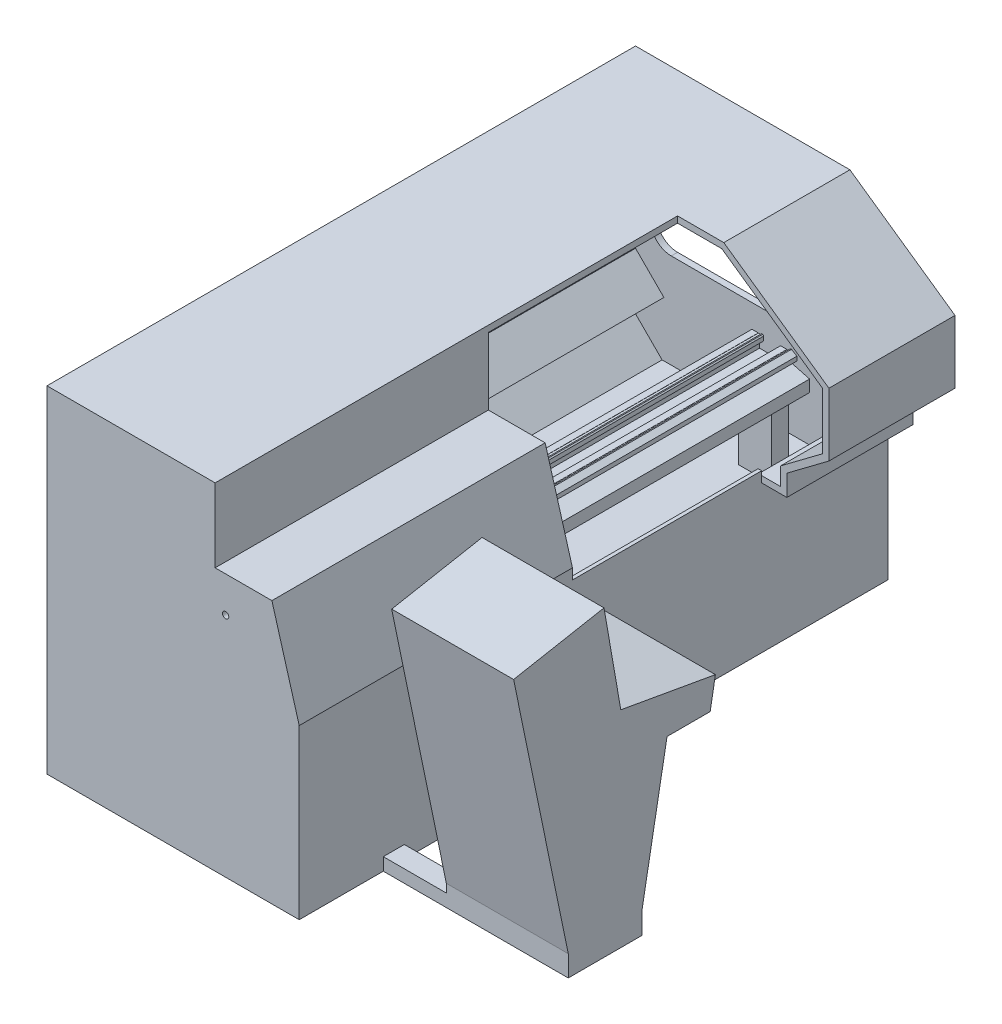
from build123d import *

# Parameters (mm, degrees)
EXTRUSION1_DEPTH        = 2800
ENL_V_MAT_EXTRU_1_DEPTH = 2200
ENL_V_MAT_EXTRU_2_DEPTH = 1470
ESQUISSE4_W             = 900
ESQUISSE4_H             = 820
ENL_V_MAT_EXTRU_3_DEPTH = 500
ENL_V_MAT_EXTRU_4_DEPTH = 570
ENL_V_MAT_EXTRU_5_DEPTH = 570
ESQUISSE16_W            = 1360
ESQUISSE16_H            = 160.91883092
ENL_V_MAT_EXTRU_6_DEPTH = 3577.862427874
ESQUISSE17_R            = 85
EXTRUSION8_DEPTH        = 34
ESQUISSE18_R            = 70
EXTRUSION9_DEPTH        = 6
EXTRUSION10_DEPTH       = 1300
EXTRUSION11_DEPTH       = 80
ESQUISSE26_W            = 157.12293572
ESQUISSE26_H            = 350
EXTRUSION12_DEPTH       = 80
ESQUISSE27_R            = 67
EXTRUSION13_DEPTH       = 10
ESQUISSE29_R            = 14.85
ENL_V_MAT_EXTRU_7_DEPTH = 4000
ESQUISSE30_W            = 100
ESQUISSE30_H            = 60
EXTRUSION14_DEPTH       = 300
EXTRUSION15_DEPTH       = 580


with BuildPart() as part:
    # Esquisse1 → Extrusion1 (new body)
    with BuildSketch(Plane.XY):
        Polygon((1020, 1600), (1520, 1250), (1520, 950), (1320, 800), (1320, 700), (1200, 700), (1200, 0), (0, 0), (0, 1600), align=None)
    extrude(amount=-EXTRUSION1_DEPTH)

    # Esquisse2 → Enl_v. mat.-Extru.1 (cut)
    with BuildSketch(Plane.XY):
        Polygon((1200, 700), (1200, 800), (1070, 1250), (800, 1250), (800, 1600), (900, 1736.899318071), (1604.056992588, 1736.899318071), (1604.056992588, 700), align=None)
    extrude(amount=-ENL_V_MAT_EXTRU_1_DEPTH, mode=Mode.SUBTRACT)

    # Esquisse3 → Enl_v. mat.-Extru.2 (cut)
    with BuildSketch(Plane.XY.offset(-1300)):
        Polygon((30, 1570), (770, 1570), (770, 1220), (1047.439897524, 1220), (1185, 743.830414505), (1185, 663.830414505), (921.169585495, 400), (156.52089488, 400), (30, 526.52089488), (165, 661.52089488), (30, 796.52089488), align=None)
    extrude(amount=-ENL_V_MAT_EXTRU_2_DEPTH, mode=Mode.SUBTRACT)

    # Esquisse4 → Enl_v. mat.-Extru.3 (cut)
    with BuildSketch(Plane(origin=(1200, 0, 0), x_dir=(0, 0, -1), z_dir=(1, 0, 0))):
        with Locations((1750, 1160)):
            Rectangle(ESQUISSE4_W, ESQUISSE4_H)
    extrude(amount=-ENL_V_MAT_EXTRU_3_DEPTH, mode=Mode.SUBTRACT)

    # Esquisse5 → Enl_v. mat.-Extru.4 (cut)
    with BuildSketch(Plane.XY.offset(-2200)):
        Polygon((730.607861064, 1570), (1010.543333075, 1570), (1490, 1234.380333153), (1490, 965), (1290, 815), (1290, 730), (1132.731421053, 730), (685.569965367, 1098.594333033), align=None)
    extrude(amount=-ENL_V_MAT_EXTRU_4_DEPTH, mode=Mode.SUBTRACT)

    # Esquisse6 → Enl_v. mat.-Extru.5 (cut)
    with BuildSketch(Plane(origin=(0, 0, -2800), x_dir=(-1, 0, 0), z_dir=(0, 0, -1))):
        with BuildLine():
            Line((-956.955553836, 1500), (-200, 1500))
            ThreePointArc((-200, 1500), (-129.289321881, 1470.710678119), (-100, 1400))
            Line((-100, 1400), (-100, 950))
            ThreePointArc((-100, 950), (-129.289321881, 879.289321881), (-200, 850))
            Line((-200, 850), (-1200, 850))
            ThreePointArc((-1200, 850), (-1270.710678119, 879.289321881), (-1300, 950))
            Line((-1300, 950), (-1300, 1229.868887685))
            ThreePointArc((-1300, 1229.868887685), (-1288.697867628, 1276.049925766), (-1257.346234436, 1311.792079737))
            Line((-1257.346234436, 1311.792079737), (-1014.301788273, 1481.923192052))
            ThreePointArc((-1014.301788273, 1481.923192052), (-987.019492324, 1495.373788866), (-956.955553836, 1500))
        make_face()
    extrude(amount=-ENL_V_MAT_EXTRU_5_DEPTH, mode=Mode.SUBTRACT)

    # Esquisse16 → Enl_v. mat.-Extru.6 (cut, through all)
    with BuildSketch(Plane(origin=(-248.26044744, 248.26044744, 0), x_dir=(0, 0, -1), z_dir=(0.7071067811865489, -0.7071067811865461, 0))):
        with Locations((2060, 473.979114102)):
            Rectangle(ESQUISSE16_W, ESQUISSE16_H)
    extrude(amount=-ENL_V_MAT_EXTRU_6_DEPTH, mode=Mode.SUBTRACT)

    # Esquisse17 → Extrusion8 (add)
    with BuildSketch(Plane(origin=(0, 0, -1300), x_dir=(-1, 0, 0), z_dir=(0, 0, -1))):
        with Locations((-850, 1080)):
            Circle(ESQUISSE17_R)
    extrude(amount=EXTRUSION8_DEPTH)

    # Esquisse18 → Extrusion9 (add)
    with BuildSketch(Plane(origin=(0, 0, -1334), x_dir=(-1, 0, 0), z_dir=(0, 0, -1))):
        with Locations((-850, 1080)):
            Circle(ESQUISSE18_R)
    extrude(amount=EXTRUSION9_DEPTH)

    # Esquisse20 → Extrusion10 (add)
    with BuildSketch(Plane(origin=(0, 0, -1300), x_dir=(-1, 0, 0), z_dir=(0, 0, -1))):
        Polygon((-784, 910), (-754, 910), (-754, 786.113248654), (-828, 786.113248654), (-828, 736.124355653), (-928, 736.124355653), (-928, 786.113248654), (-1028, 786.113248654), (-1028, 841.997821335), (-938, 866.113248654), (-938, 886.113248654), (-968, 886.113248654), (-968, 906.113248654), (-942, 921.124355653), (-937, 921.124355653), (-930, 909), (-920, 909), (-920, 910), (-890, 910), (-890, 890), (-910, 890), (-910, 850), (-790, 850), (-790, 890), (-810, 890), (-810, 910), (-805, 915), (-800, 915), (-794, 909), (-784, 909), align=None)
    extrude(amount=EXTRUSION10_DEPTH)

    # Esquisse25 → Extrusion11 (add)
    with BuildSketch(Plane(origin=(0, 0, -1300), x_dir=(-1, 0, 0), z_dir=(0, 0, -1))):
        Polygon((-1146.265696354, 620), (-928, 620), (-928, 736.124355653), (-828, 736.124355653), (-828, 620), (-30, 620), (-30, 526.52089488), (-156.52089488, 400), (-921.169585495, 400), align=None)
    extrude(amount=EXTRUSION11_DEPTH)

    # Esquisse26 → Extrusion12 (add)
    with BuildSketch(Plane(origin=(0, 0, -2600), x_dir=(-1, 0, 0), z_dir=(0, 0, -1))):
        with Locations((-849.43853214, 561.124355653)):
            Rectangle(ESQUISSE26_W, ESQUISSE26_H)
    extrude(amount=-EXTRUSION12_DEPTH)

    # Esquisse27 → Extrusion13 (add)
    with BuildSketch(Plane(origin=(0, 0, -1340), x_dir=(-1, 0, 0), z_dir=(0, 0, -1))):
        with Locations((-850, 1080)):
            Circle(ESQUISSE27_R)
    extrude(amount=EXTRUSION13_DEPTH)

    # Esquisse29 → Enl_v. mat.-Extru.7 (cut)
    with BuildSketch(Plane(origin=(0, 0, -1350), x_dir=(-1, 0, 0), z_dir=(0, 0, -1))):
        with Locations((-850, 1080)):
            Circle(ESQUISSE29_R)
    extrude(amount=-ENL_V_MAT_EXTRU_7_DEPTH, mode=Mode.SUBTRACT)

    # Esquisse30 → Extrusion14 (add)
    with BuildSketch(Plane(origin=(1200, 0, 0), x_dir=(0, 0, -1), z_dir=(1, 0, 0))):
        with Locations((450, 30)):
            Rectangle(ESQUISSE30_W, ESQUISSE30_H)
    extrude(amount=EXTRUSION14_DEPTH)

    # Esquisse31 → Extrusion15 (add)
    with BuildSketch(Plane(origin=(1500, 0, 0), x_dir=(0, 0, -1), z_dir=(1, 0, 0))):
        Polygon((400, 0), (750, 0), (750, 100), (870, 760), (1075.111111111, 760), (1100, 900), (650, 980), (570, 1440), (140, 1360), (400, 100), align=None)
    extrude(amount=EXTRUSION15_DEPTH)


solid = part.part
